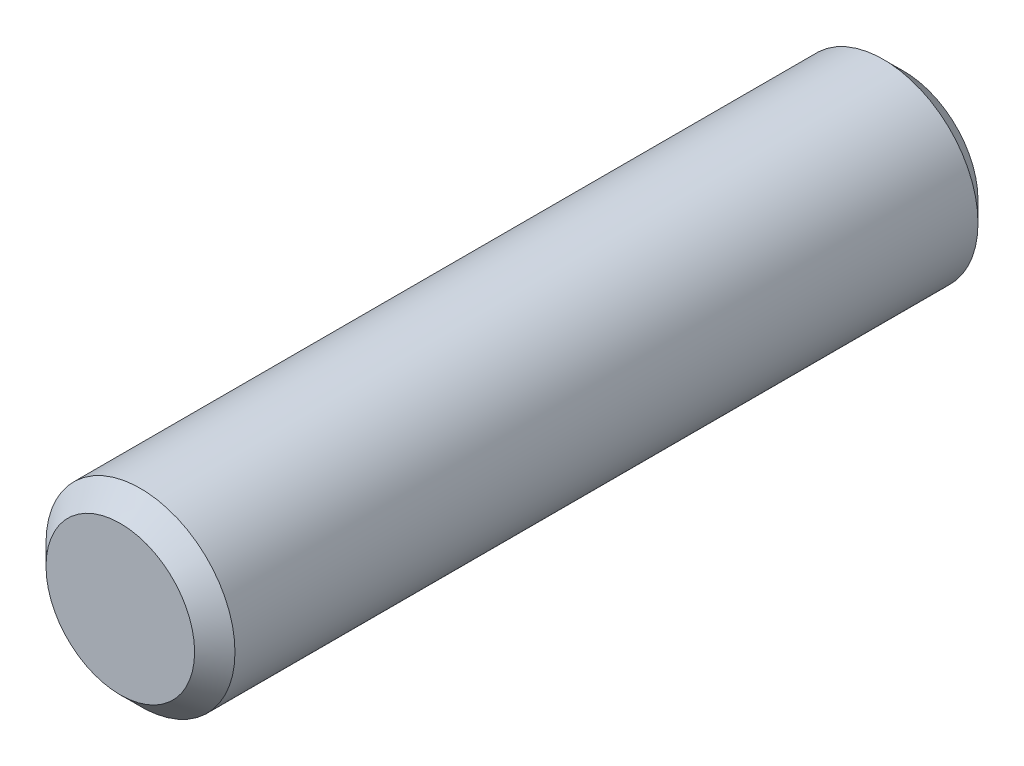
from build123d import *

# Parameters (mm, degrees)
SKETCH2_R          = 2.9718
BASE_EXTRUDE_DEPTH = 12.319
CHAMFER1_SIZE      = 0.635


with BuildPart() as part:
    # Sketch2 → Base-Extrude (new, symmetric)
    with BuildSketch(Plane.XY):
        with Locations(Location((0, 0, 0), (0, 0, 180))):
            Circle(SKETCH2_R)
    extrude(amount=BASE_EXTRUDE_DEPTH, both=True)

    # Chamfer1
    chamfer1_edges = [part.edges().sort_by_distance(p)[0] for p in [
        (2.9718, 0, -12.319),
        (2.9718, 0, 12.319),
    ]]
    chamfer(chamfer1_edges, length=CHAMFER1_SIZE)


solid = part.part
